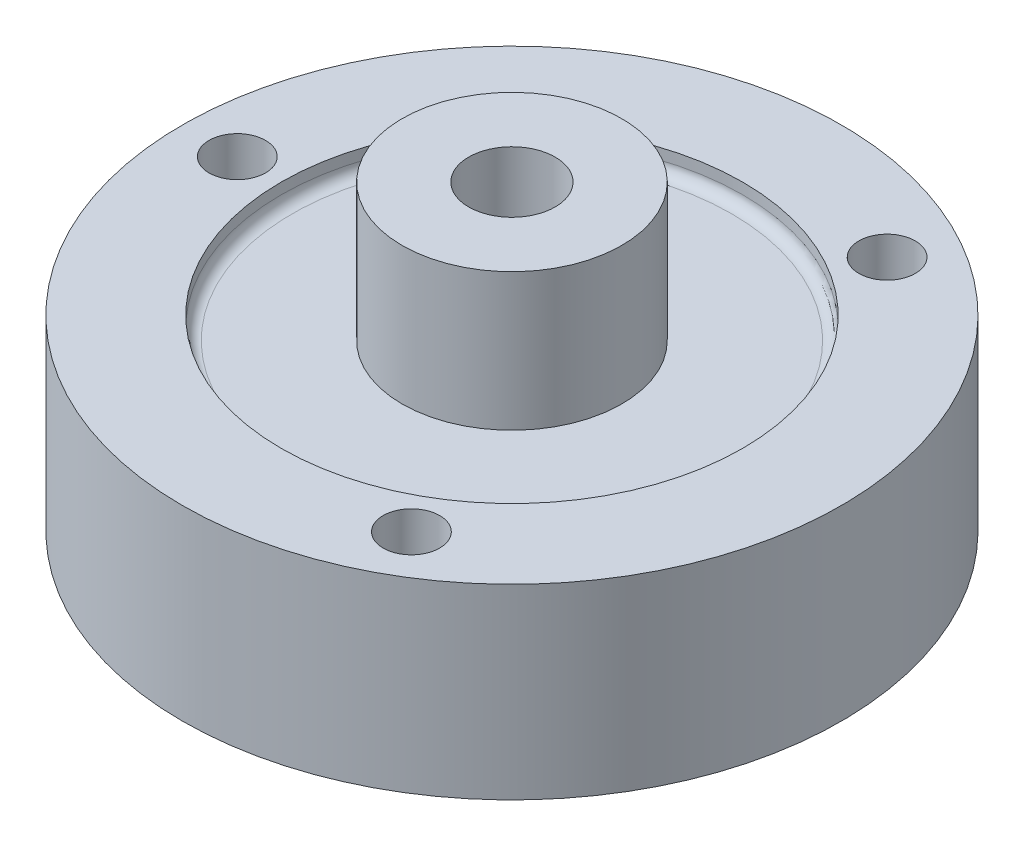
from build123d import *

# Parameters (mm, degrees)
SKETCH1_R                    = 19.05
BOSS_EXTRUDE1_DEPTH          = 10.795
SKETCH2_R                    = 5.715
TRANSDUCER_FORCE_PLATE_DEPTH = 2.54
SKETCH7_R                    = 13.335
CUT_EXTRUDE2_DEPTH           = 1.27
FILLET1_R                    = 0.635
F_30_0_1285_DIAMETER_HOLE1_D = 3.2639
CIRPATTERN1_COUNT            = 3
SKETCH10_R                   = 6.35
BOSS_EXTRUDE2_DEPTH          = 7.9375
M6X1_0_TAPPED_HOLE1_D        = 5
M6X1_0_TAPPED_HOLE1_DEPTH    = 14.9999954
M6X1_0_TAPPED_HOLE1_TIP      = 1.502151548


with BuildPart() as part:
    # Sketch1 → Boss-Extrude1 (new body)
    with BuildSketch(Plane(origin=(0.004846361, 0, -0.043911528), x_dir=(1, 0, 0), z_dir=(0, 1, 0))):
        with Locations(Location((-0.004846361, -0.043911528, 0), (0, 0, 270))):
            Circle(SKETCH1_R)
    extrude(amount=BOSS_EXTRUDE1_DEPTH)

    # Sketch2 → Transducer force plate (add)
    with BuildSketch(Plane.XZ):
        with Locations(Location((0, 0, 0), (0, 0, 270))):
            Circle(SKETCH2_R)
    extrude(amount=TRANSDUCER_FORCE_PLATE_DEPTH)

    # Sketch7 → Cut-Extrude2 (cut)
    with BuildSketch(Plane(origin=(0, 10.795, 0), x_dir=(1, 0, 0), z_dir=(0, 1, 0))):
        with Locations(Location((0, 0, 0), (0, 0, 270))):
            Circle(SKETCH7_R)
    extrude(amount=-CUT_EXTRUDE2_DEPTH, mode=Mode.SUBTRACT)

    # Fillet1
    fillet1_edges = [part.edges().sort_by_distance(p)[0] for p in [
        (0, 9.525, -13.335),
        (0, 0, 5.715),
    ]]
    fillet(fillet1_edges, radius=FILLET1_R)

    # 30 _0.1285_ Diameter Hole1 (through all)
    with Locations(Plane(origin=(0, 10.795, 0), x_dir=(1, 0, 0), z_dir=(0, 1, 0))):
        with Locations((-15.875, 0)):
            f_30_0_1285_diameter_hole1 = Hole(F_30_0_1285_DIAMETER_HOLE1_D / 2)

    # CirPattern1: 30 _0.1285_ Diameter Hole1 ×3 about axis
    cirpattern1_axis = Axis((0, 0, 0), (0, 1, 0))
    for i in range(1, CIRPATTERN1_COUNT):
        add(f_30_0_1285_diameter_hole1.rotate(cirpattern1_axis, i * 360 / CIRPATTERN1_COUNT), mode=Mode.SUBTRACT)

    # Sketch10 → Boss-Extrude2 (add)
    with BuildSketch(Plane(origin=(0, 9.525, 0), x_dir=(1, 0, 0), z_dir=(0, 1, 0))):
        with Locations(Location((0, 0, 0), (0, 0, 270))):
            Circle(SKETCH10_R)
    extrude(amount=BOSS_EXTRUDE2_DEPTH)

    # M6x1.0 Tapped Hole1
    with Locations(Plane(origin=(0, 17.4625, 0), x_dir=(1, 0, 0), z_dir=(0, 1, 0))):
        with Locations((0, 0)):
            Hole(M6X1_0_TAPPED_HOLE1_D / 2, depth=M6X1_0_TAPPED_HOLE1_DEPTH)
            with Locations((0, 0, -(M6X1_0_TAPPED_HOLE1_DEPTH + M6X1_0_TAPPED_HOLE1_TIP / 2))):  # 118° drill point
                Cone(0, M6X1_0_TAPPED_HOLE1_D / 2, M6X1_0_TAPPED_HOLE1_TIP, mode=Mode.SUBTRACT)


solid = part.part
